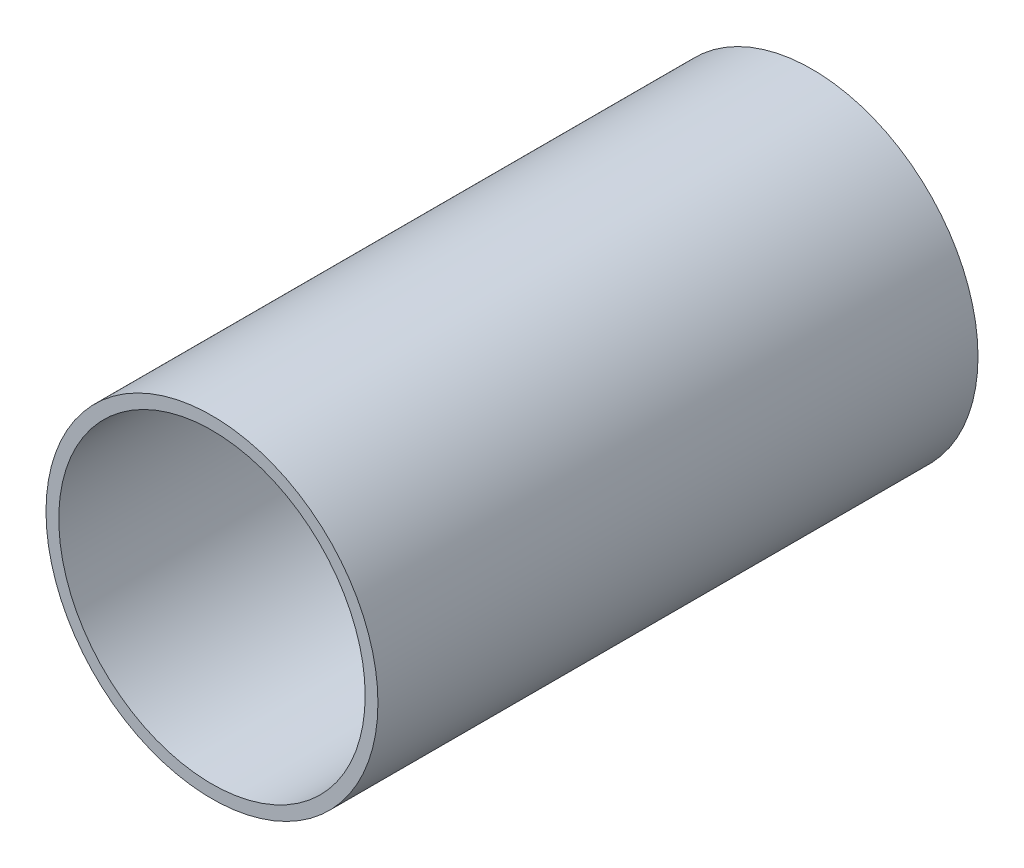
from build123d import *

# Parameters (mm, degrees)
SKETCH1_R           = 82.55
SKETCH1_R_2         = 76.2
BOSS_EXTRUDE1_DEPTH = 149.225


with BuildPart() as part:
    # Sketch1 → Boss-Extrude1 (new, symmetric)
    with BuildSketch(Plane.XY):
        Circle(SKETCH1_R)
        Circle(SKETCH1_R_2, mode=Mode.SUBTRACT)
    extrude(amount=BOSS_EXTRUDE1_DEPTH, both=True)


solid = part.part
